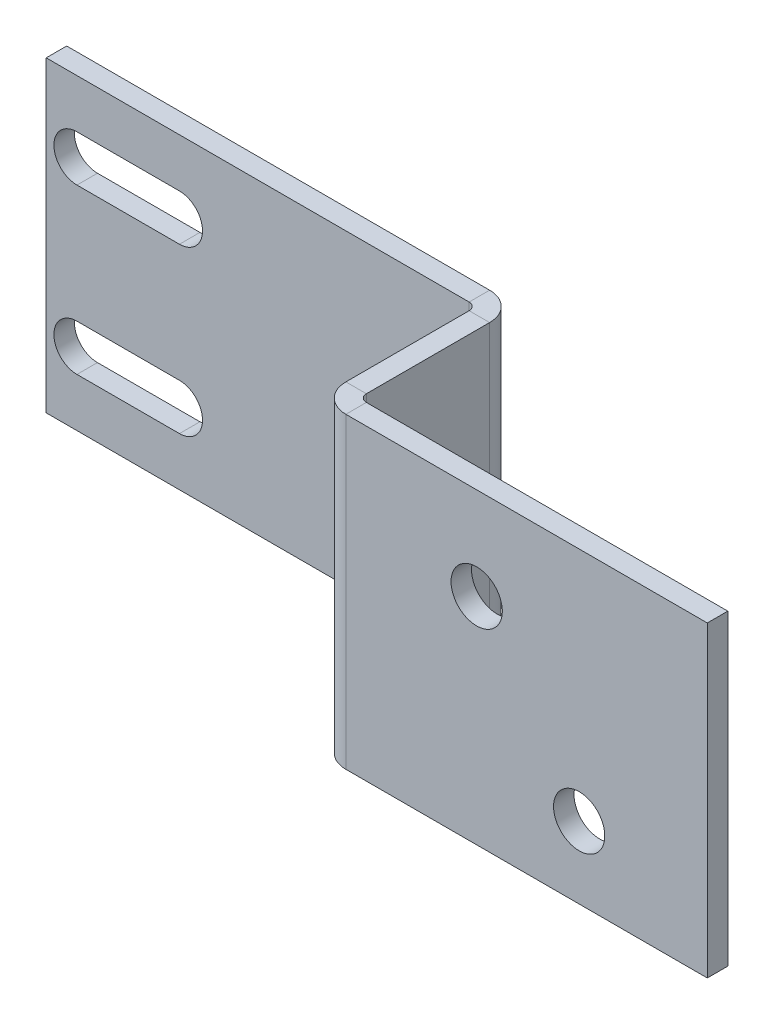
ISO-10303-21;
HEADER;
FILE_DESCRIPTION(('STEP AP214'),'2;1');
FILE_NAME('part.step','',(''),(''),'','','');
FILE_SCHEMA(('AUTOMOTIVE_DESIGN { 1 0 10303 214 1 1 1 1 }'));
ENDSEC;
DATA;
#1=APPLICATION_CONTEXT('core data for automotive mechanical design processes');
#2=APPLICATION_PROTOCOL_DEFINITION('international standard','automotive_design',2000,#1);
#3=PRODUCT_CONTEXT('',#1,'mechanical');
#4=PRODUCT('Part','Part','',(#3));
#5=PRODUCT_RELATED_PRODUCT_CATEGORY('part','',(#4));
#6=PRODUCT_DEFINITION_FORMATION('','',#4);
#7=PRODUCT_DEFINITION_CONTEXT('part definition',#1,'design');
#8=PRODUCT_DEFINITION('design','',#6,#7);
#9=PRODUCT_DEFINITION_SHAPE('','',#8);
#10=(LENGTH_UNIT() NAMED_UNIT(*) SI_UNIT(.MILLI.,.METRE.));
#11=(NAMED_UNIT(*) PLANE_ANGLE_UNIT() SI_UNIT($,.RADIAN.));
#12=(NAMED_UNIT(*) SI_UNIT($,.STERADIAN.) SOLID_ANGLE_UNIT());
#13=UNCERTAINTY_MEASURE_WITH_UNIT(LENGTH_MEASURE(1.E-05),#10,'distance_accuracy_value','');
#14=(GEOMETRIC_REPRESENTATION_CONTEXT(3) GLOBAL_UNCERTAINTY_ASSIGNED_CONTEXT((#13)) GLOBAL_UNIT_ASSIGNED_CONTEXT((#10,
#11,#12)) REPRESENTATION_CONTEXT('',''));
#15=CARTESIAN_POINT('',(0.,0.,0.));
#16=DIRECTION('',(0.,0.,1.));
#17=DIRECTION('',(1.,0.,0.));
#18=AXIS2_PLACEMENT_3D('',#15,#16,#17);
#19=CARTESIAN_POINT('',(32.,-51.5236276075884,0.));
#20=DIRECTION('',(0.,1.,0.));
#21=DIRECTION('',(-1.,0.,0.));
#22=AXIS2_PLACEMENT_3D('',#19,#20,#21);
#23=PLANE('',#22);
#24=DIRECTION('',(-1.,0.,0.));
#25=VECTOR('',#24,1.);
#26=CARTESIAN_POINT('',(32.,-51.5236276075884,12.7634));
#27=LINE('',#26,#25);
#28=CARTESIAN_POINT('',(32.,-51.5236276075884,12.7634));
#29=VERTEX_POINT('',#28);
#30=CARTESIAN_POINT('',(30.,-51.5236276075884,12.7634));
#31=VERTEX_POINT('',#30);
#32=EDGE_CURVE('E262',#29,#31,#27,.T.);
#33=ORIENTED_EDGE('',*,*,#32,.T.);
#34=DIRECTION('',(0.,0.,1.));
#35=VECTOR('',#34,1.);
#36=CARTESIAN_POINT('',(30.,-51.5236276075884,0.));
#37=LINE('',#36,#35);
#38=CARTESIAN_POINT('',(30.,-51.5236276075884,0.7366));
#39=VERTEX_POINT('',#38);
#40=EDGE_CURVE('E287',#31,#39,#37,.F.);
#41=ORIENTED_EDGE('',*,*,#40,.T.);
#42=DIRECTION('',(-1.,0.,0.));
#43=VECTOR('',#42,1.);
#44=CARTESIAN_POINT('',(32.,-51.5236276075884,0.73659999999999));
#45=LINE('',#44,#43);
#46=CARTESIAN_POINT('',(32.,-51.5236276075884,0.73659999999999));
#47=VERTEX_POINT('',#46);
#48=EDGE_CURVE('E275',#39,#47,#45,.F.);
#49=ORIENTED_EDGE('',*,*,#48,.T.);
#50=DIRECTION('',(0.,0.,-1.));
#51=VECTOR('',#50,1.);
#52=CARTESIAN_POINT('',(32.,-51.5236276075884,-1.21586629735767E-13));
#53=LINE('',#52,#51);
#54=EDGE_CURVE('E282',#29,#47,#53,.T.);
#55=ORIENTED_EDGE('',*,*,#54,.F.);
#56=EDGE_LOOP('',(#33,#41,#49,#55));
#57=FACE_BOUND('',#56,.T.);
#58=ADVANCED_FACE('F16',(#57),#23,.F.);
#59=CARTESIAN_POINT('',(32.,-21.5236276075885,15.5));
#60=DIRECTION('',(0.,-1.,0.));
#61=DIRECTION('',(0.,0.,-1.));
#62=AXIS2_PLACEMENT_3D('',#59,#60,#61);
#63=PLANE('',#62);
#64=DIRECTION('',(-1.,0.,0.));
#65=VECTOR('',#64,1.);
#66=CARTESIAN_POINT('',(32.,-21.5236276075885,12.7634));
#67=LINE('',#66,#65);
#68=CARTESIAN_POINT('',(32.,-21.5236276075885,12.7634));
#69=VERTEX_POINT('',#68);
#70=CARTESIAN_POINT('',(30.,-21.5236276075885,12.7634));
#71=VERTEX_POINT('',#70);
#72=EDGE_CURVE('E272',#69,#71,#67,.T.);
#73=ORIENTED_EDGE('',*,*,#72,.F.);
#74=DIRECTION('',(0.,0.,1.));
#75=VECTOR('',#74,1.);
#76=CARTESIAN_POINT('',(32.,-21.5236276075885,-1.45675366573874E-13));
#77=LINE('',#76,#75);
#78=CARTESIAN_POINT('',(32.,-21.5236276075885,0.736599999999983));
#79=VERTEX_POINT('',#78);
#80=EDGE_CURVE('E278',#79,#69,#77,.T.);
#81=ORIENTED_EDGE('',*,*,#80,.F.);
#82=DIRECTION('',(-1.,0.,0.));
#83=VECTOR('',#82,1.);
#84=CARTESIAN_POINT('',(30.,-21.5236276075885,0.73659999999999));
#85=LINE('',#84,#83);
#86=CARTESIAN_POINT('',(30.,-21.5236276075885,0.73659999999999));
#87=VERTEX_POINT('',#86);
#88=EDGE_CURVE('E292',#87,#79,#85,.F.);
#89=ORIENTED_EDGE('',*,*,#88,.F.);
#90=DIRECTION('',(0.,0.,-1.));
#91=VECTOR('',#90,1.);
#92=CARTESIAN_POINT('',(30.,-21.5236276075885,15.5));
#93=LINE('',#92,#91);
#94=EDGE_CURVE('E284',#87,#71,#93,.F.);
#95=ORIENTED_EDGE('',*,*,#94,.T.);
#96=EDGE_LOOP('',(#73,#81,#89,#95));
#97=FACE_BOUND('',#96,.T.);
#98=ADVANCED_FACE('F372',(#97),#63,.F.);
#99=CARTESIAN_POINT('',(32.,0.,-1.21586629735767E-13));
#100=DIRECTION('',(-1.,0.,0.));
#101=DIRECTION('',(0.,0.,1.));
#102=AXIS2_PLACEMENT_3D('',#99,#100,#101);
#103=PLANE('',#102);
#104=DIRECTION('',(0.,-1.,0.));
#105=VECTOR('',#104,1.);
#106=CARTESIAN_POINT('',(32.,-51.5236276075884,12.7634));
#107=LINE('',#106,#105);
#108=EDGE_CURVE('E268',#29,#69,#107,.F.);
#109=ORIENTED_EDGE('',*,*,#108,.F.);
#110=ORIENTED_EDGE('',*,*,#54,.T.);
#111=DIRECTION('',(0.,1.,0.));
#112=VECTOR('',#111,1.);
#113=CARTESIAN_POINT('',(32.,-51.5236276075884,0.73659999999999));
#114=LINE('',#113,#112);
#115=EDGE_CURVE('E289',#79,#47,#114,.F.);
#116=ORIENTED_EDGE('',*,*,#115,.F.);
#117=ORIENTED_EDGE('',*,*,#80,.T.);
#118=EDGE_LOOP('',(#109,#110,#116,#117));
#119=FACE_BOUND('',#118,.T.);
#120=ADVANCED_FACE('F375',(#119),#103,.F.);
#121=CARTESIAN_POINT('',(30.,0.,-1.1460366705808E-13));
#122=DIRECTION('',(-1.,0.,0.));
#123=DIRECTION('',(0.,0.,1.));
#124=AXIS2_PLACEMENT_3D('',#121,#122,#123);
#125=PLANE('',#124);
#126=ORIENTED_EDGE('',*,*,#40,.F.);
#127=DIRECTION('',(0.,-1.,0.));
#128=VECTOR('',#127,1.);
#129=CARTESIAN_POINT('',(30.,-51.5236276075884,12.7634));
#130=LINE('',#129,#128);
#131=EDGE_CURVE('E255',#31,#71,#130,.F.);
#132=ORIENTED_EDGE('',*,*,#131,.T.);
#133=ORIENTED_EDGE('',*,*,#94,.F.);
#134=DIRECTION('',(0.,1.,0.));
#135=VECTOR('',#134,1.);
#136=CARTESIAN_POINT('',(30.,-51.5236276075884,0.7366));
#137=LINE('',#136,#135);
#138=EDGE_CURVE('E295',#39,#87,#137,.T.);
#139=ORIENTED_EDGE('',*,*,#138,.F.);
#140=EDGE_LOOP('',(#126,#132,#133,#139));
#141=FACE_BOUND('',#140,.T.);
#142=ADVANCED_FACE('F363',(#141),#125,.T.);
#143=CARTESIAN_POINT('',(-12.,-21.5236276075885,-2.));
#144=DIRECTION('',(0.,1.,0.));
#145=DIRECTION('',(0.,0.,1.));
#146=AXIS2_PLACEMENT_3D('',#143,#144,#145);
#147=PLANE('',#146);
#148=DIRECTION('',(-1.,0.,0.));
#149=VECTOR('',#148,1.);
#150=CARTESIAN_POINT('',(-12.,-21.5236276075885,0.));
#151=LINE('',#150,#149);
#152=CARTESIAN_POINT('',(29.2634,-21.5236276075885,0.));
#153=VERTEX_POINT('',#152);
#154=CARTESIAN_POINT('',(-12.,-21.5236276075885,0.));
#155=VERTEX_POINT('',#154);
#156=EDGE_CURVE('E326',#153,#155,#151,.T.);
#157=ORIENTED_EDGE('',*,*,#156,.F.);
#158=DIRECTION('',(0.,0.,-1.));
#159=VECTOR('',#158,1.);
#160=CARTESIAN_POINT('',(29.2634,-21.5236276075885,0.));
#161=LINE('',#160,#159);
#162=CARTESIAN_POINT('',(29.2634,-21.5236276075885,-2.));
#163=VERTEX_POINT('',#162);
#164=EDGE_CURVE('E305',#153,#163,#161,.T.);
#165=ORIENTED_EDGE('',*,*,#164,.T.);
#166=DIRECTION('',(-1.,0.,0.));
#167=VECTOR('',#166,1.);
#168=CARTESIAN_POINT('',(-12.,-21.5236276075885,-2.));
#169=LINE('',#168,#167);
#170=CARTESIAN_POINT('',(-12.,-21.5236276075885,-2.));
#171=VERTEX_POINT('',#170);
#172=EDGE_CURVE('E329',#163,#171,#169,.T.);
#173=ORIENTED_EDGE('',*,*,#172,.T.);
#174=DIRECTION('',(0.,0.,1.));
#175=VECTOR('',#174,1.);
#176=CARTESIAN_POINT('',(-12.,-21.5236276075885,-2.));
#177=LINE('',#176,#175);
#178=EDGE_CURVE('E11',#171,#155,#177,.T.);
#179=ORIENTED_EDGE('',*,*,#178,.T.);
#180=EDGE_LOOP('',(#157,#165,#173,#179));
#181=FACE_BOUND('',#180,.T.);
#182=ADVANCED_FACE('F343',(#181),#147,.T.);
#183=CARTESIAN_POINT('',(0.,0.,-2.));
#184=DIRECTION('',(0.,0.,1.));
#185=DIRECTION('',(1.,0.,0.));
#186=AXIS2_PLACEMENT_3D('',#183,#184,#185);
#187=PLANE('',#186);
#188=DIRECTION('',(-1.,0.,0.));
#189=VECTOR('',#188,1.);
#190=CARTESIAN_POINT('',(-9.,-42.2736276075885,-2.));
#191=LINE('',#190,#189);
#192=CARTESIAN_POINT('',(0.99999999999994,-42.2736276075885,-2.));
#193=VERTEX_POINT('',#192);
#194=CARTESIAN_POINT('',(-9.,-42.2736276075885,-2.));
#195=VERTEX_POINT('',#194);
#196=EDGE_CURVE('E161',#193,#195,#191,.T.);
#197=ORIENTED_EDGE('',*,*,#196,.T.);
#198=CARTESIAN_POINT('',(-9.,-44.5236276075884,-2.));
#199=DIRECTION('',(0.,0.,1.));
#200=DIRECTION('',(-1.,0.,0.));
#201=AXIS2_PLACEMENT_3D('',#198,#199,#200);
#202=CIRCLE('',#201,2.25);
#203=CARTESIAN_POINT('',(-9.,-46.7736276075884,-2.));
#204=VERTEX_POINT('',#203);
#205=EDGE_CURVE('E155',#195,#204,#202,.T.);
#206=ORIENTED_EDGE('',*,*,#205,.T.);
#207=DIRECTION('',(1.,0.,0.));
#208=VECTOR('',#207,1.);
#209=CARTESIAN_POINT('',(-9.,-46.7736276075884,-2.));
#210=LINE('',#209,#208);
#211=CARTESIAN_POINT('',(0.999999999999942,-46.7736276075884,-2.));
#212=VERTEX_POINT('',#211);
#213=EDGE_CURVE('E164',#204,#212,#210,.T.);
#214=ORIENTED_EDGE('',*,*,#213,.T.);
#215=CARTESIAN_POINT('',(0.999999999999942,-44.5236276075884,-2.));
#216=DIRECTION('',(0.,0.,1.));
#217=DIRECTION('',(-1.,0.,0.));
#218=AXIS2_PLACEMENT_3D('',#215,#216,#217);
#219=CIRCLE('',#218,2.25);
#220=EDGE_CURVE('E31',#212,#193,#219,.T.);
#221=ORIENTED_EDGE('',*,*,#220,.T.);
#222=EDGE_LOOP('',(#197,#206,#214,#221));
#223=FACE_BOUND('',#222,.T.);
#224=DIRECTION('',(-1.,0.,0.));
#225=VECTOR('',#224,1.);
#226=CARTESIAN_POINT('',(-9.,-26.2736276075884,-2.));
#227=LINE('',#226,#225);
#228=CARTESIAN_POINT('',(0.999999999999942,-26.2736276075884,-2.));
#229=VERTEX_POINT('',#228);
#230=CARTESIAN_POINT('',(-9.,-26.2736276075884,-2.));
#231=VERTEX_POINT('',#230);
#232=EDGE_CURVE('E203',#229,#231,#227,.T.);
#233=ORIENTED_EDGE('',*,*,#232,.T.);
#234=CARTESIAN_POINT('',(-9.,-28.5236276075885,-2.));
#235=DIRECTION('',(0.,0.,1.));
#236=DIRECTION('',(1.,0.,0.));
#237=AXIS2_PLACEMENT_3D('',#234,#235,#236);
#238=CIRCLE('',#237,2.25);
#239=CARTESIAN_POINT('',(-9.,-30.7736276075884,-2.));
#240=VERTEX_POINT('',#239);
#241=EDGE_CURVE('E193',#231,#240,#238,.T.);
#242=ORIENTED_EDGE('',*,*,#241,.T.);
#243=DIRECTION('',(1.,0.,0.));
#244=VECTOR('',#243,1.);
#245=CARTESIAN_POINT('',(-9.,-30.7736276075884,-2.));
#246=LINE('',#245,#244);
#247=CARTESIAN_POINT('',(0.999999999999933,-30.7736276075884,-2.));
#248=VERTEX_POINT('',#247);
#249=EDGE_CURVE('E196',#240,#248,#246,.T.);
#250=ORIENTED_EDGE('',*,*,#249,.T.);
#251=CARTESIAN_POINT('',(0.999999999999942,-28.5236276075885,-2.));
#252=DIRECTION('',(0.,0.,1.));
#253=DIRECTION('',(1.,0.,0.));
#254=AXIS2_PLACEMENT_3D('',#251,#252,#253);
#255=CIRCLE('',#254,2.25);
#256=EDGE_CURVE('E200',#248,#229,#255,.T.);
#257=ORIENTED_EDGE('',*,*,#256,.T.);
#258=EDGE_LOOP('',(#233,#242,#250,#257));
#259=FACE_BOUND('',#258,.T.);
#260=DIRECTION('',(0.,1.,0.));
#261=VECTOR('',#260,1.);
#262=CARTESIAN_POINT('',(29.2634,-21.5236276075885,-2.));
#263=LINE('',#262,#261);
#264=CARTESIAN_POINT('',(29.2634,-51.5236276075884,-2.));
#265=VERTEX_POINT('',#264);
#266=EDGE_CURVE('E299',#163,#265,#263,.F.);
#267=ORIENTED_EDGE('',*,*,#266,.T.);
#268=DIRECTION('',(1.,0.,0.));
#269=VECTOR('',#268,1.);
#270=CARTESIAN_POINT('',(-12.,-51.5236276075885,-2.));
#271=LINE('',#270,#269);
#272=CARTESIAN_POINT('',(-12.,-51.5236276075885,-2.));
#273=VERTEX_POINT('',#272);
#274=EDGE_CURVE('E325',#273,#265,#271,.T.);
#275=ORIENTED_EDGE('',*,*,#274,.F.);
#276=DIRECTION('',(0.,-1.,0.));
#277=VECTOR('',#276,1.);
#278=CARTESIAN_POINT('',(-12.,-21.5236276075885,-2.));
#279=LINE('',#278,#277);
#280=EDGE_CURVE('E322',#171,#273,#279,.T.);
#281=ORIENTED_EDGE('',*,*,#280,.F.);
#282=ORIENTED_EDGE('',*,*,#172,.F.);
#283=EDGE_LOOP('',(#267,#275,#281,#282));
#284=FACE_BOUND('',#283,.T.);
#285=ADVANCED_FACE('F168',(#223,#259,#284),#187,.F.);
#286=CARTESIAN_POINT('',(0.,0.,0.));
#287=DIRECTION('',(0.,0.,1.));
#288=DIRECTION('',(1.,0.,0.));
#289=AXIS2_PLACEMENT_3D('',#286,#287,#288);
#290=PLANE('',#289);
#291=CARTESIAN_POINT('',(-9.,-44.5236276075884,0.));
#292=DIRECTION('',(0.,0.,1.));
#293=DIRECTION('',(-1.,0.,0.));
#294=AXIS2_PLACEMENT_3D('',#291,#292,#293);
#295=CIRCLE('',#294,2.25);
#296=CARTESIAN_POINT('',(-9.,-42.2736276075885,0.));
#297=VERTEX_POINT('',#296);
#298=CARTESIAN_POINT('',(-9.,-46.7736276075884,0.));
#299=VERTEX_POINT('',#298);
#300=EDGE_CURVE('E39',#297,#299,#295,.T.);
#301=ORIENTED_EDGE('',*,*,#300,.F.);
#302=DIRECTION('',(-1.,0.,0.));
#303=VECTOR('',#302,1.);
#304=CARTESIAN_POINT('',(-9.,-42.2736276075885,0.));
#305=LINE('',#304,#303);
#306=CARTESIAN_POINT('',(0.99999999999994,-42.2736276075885,0.));
#307=VERTEX_POINT('',#306);
#308=EDGE_CURVE('E171',#307,#297,#305,.T.);
#309=ORIENTED_EDGE('',*,*,#308,.F.);
#310=CARTESIAN_POINT('',(0.999999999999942,-44.5236276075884,0.));
#311=DIRECTION('',(0.,0.,1.));
#312=DIRECTION('',(-1.,0.,0.));
#313=AXIS2_PLACEMENT_3D('',#310,#311,#312);
#314=CIRCLE('',#313,2.25);
#315=CARTESIAN_POINT('',(0.999999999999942,-46.7736276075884,0.));
#316=VERTEX_POINT('',#315);
#317=EDGE_CURVE('E174',#316,#307,#314,.T.);
#318=ORIENTED_EDGE('',*,*,#317,.F.);
#319=DIRECTION('',(1.,0.,0.));
#320=VECTOR('',#319,1.);
#321=CARTESIAN_POINT('',(-9.,-46.7736276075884,0.));
#322=LINE('',#321,#320);
#323=EDGE_CURVE('E183',#299,#316,#322,.T.);
#324=ORIENTED_EDGE('',*,*,#323,.F.);
#325=EDGE_LOOP('',(#301,#309,#318,#324));
#326=FACE_BOUND('',#325,.T.);
#327=CARTESIAN_POINT('',(-9.,-28.5236276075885,0.));
#328=DIRECTION('',(0.,0.,1.));
#329=DIRECTION('',(1.,0.,0.));
#330=AXIS2_PLACEMENT_3D('',#327,#328,#329);
#331=CIRCLE('',#330,2.25);
#332=CARTESIAN_POINT('',(-9.,-26.2736276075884,0.));
#333=VERTEX_POINT('',#332);
#334=CARTESIAN_POINT('',(-9.,-30.7736276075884,0.));
#335=VERTEX_POINT('',#334);
#336=EDGE_CURVE('E189',#333,#335,#331,.T.);
#337=ORIENTED_EDGE('',*,*,#336,.F.);
#338=DIRECTION('',(-1.,0.,0.));
#339=VECTOR('',#338,1.);
#340=CARTESIAN_POINT('',(-9.,-26.2736276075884,0.));
#341=LINE('',#340,#339);
#342=CARTESIAN_POINT('',(0.999999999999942,-26.2736276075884,0.));
#343=VERTEX_POINT('',#342);
#344=EDGE_CURVE('E197',#343,#333,#341,.T.);
#345=ORIENTED_EDGE('',*,*,#344,.F.);
#346=CARTESIAN_POINT('',(0.999999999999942,-28.5236276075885,0.));
#347=DIRECTION('',(0.,0.,1.));
#348=DIRECTION('',(1.,0.,0.));
#349=AXIS2_PLACEMENT_3D('',#346,#347,#348);
#350=CIRCLE('',#349,2.25);
#351=CARTESIAN_POINT('',(0.999999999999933,-30.7736276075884,0.));
#352=VERTEX_POINT('',#351);
#353=EDGE_CURVE('E211',#352,#343,#350,.T.);
#354=ORIENTED_EDGE('',*,*,#353,.F.);
#355=DIRECTION('',(1.,0.,0.));
#356=VECTOR('',#355,1.);
#357=CARTESIAN_POINT('',(-9.,-30.7736276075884,0.));
#358=LINE('',#357,#356);
#359=EDGE_CURVE('E208',#335,#352,#358,.T.);
#360=ORIENTED_EDGE('',*,*,#359,.F.);
#361=EDGE_LOOP('',(#337,#345,#354,#360));
#362=FACE_BOUND('',#361,.T.);
#363=DIRECTION('',(1.,0.,0.));
#364=VECTOR('',#363,1.);
#365=CARTESIAN_POINT('',(-12.,-51.5236276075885,0.));
#366=LINE('',#365,#364);
#367=CARTESIAN_POINT('',(-12.,-51.5236276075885,0.));
#368=VERTEX_POINT('',#367);
#369=CARTESIAN_POINT('',(29.2634,-51.5236276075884,0.));
#370=VERTEX_POINT('',#369);
#371=EDGE_CURVE('E333',#368,#370,#366,.T.);
#372=ORIENTED_EDGE('',*,*,#371,.T.);
#373=DIRECTION('',(0.,1.,0.));
#374=VECTOR('',#373,1.);
#375=CARTESIAN_POINT('',(29.2634,-21.5236276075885,0.));
#376=LINE('',#375,#374);
#377=EDGE_CURVE('E311',#153,#370,#376,.F.);
#378=ORIENTED_EDGE('',*,*,#377,.F.);
#379=ORIENTED_EDGE('',*,*,#156,.T.);
#380=DIRECTION('',(0.,-1.,0.));
#381=VECTOR('',#380,1.);
#382=CARTESIAN_POINT('',(-12.,-21.5236276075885,0.));
#383=LINE('',#382,#381);
#384=EDGE_CURVE('E319',#155,#368,#383,.T.);
#385=ORIENTED_EDGE('',*,*,#384,.T.);
#386=EDGE_LOOP('',(#372,#378,#379,#385));
#387=FACE_BOUND('',#386,.T.);
#388=ADVANCED_FACE('F338',(#326,#362,#387),#290,.T.);
#389=CARTESIAN_POINT('',(-12.,-21.5236276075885,-2.));
#390=DIRECTION('',(-1.,0.,0.));
#391=DIRECTION('',(0.,-1.,0.));
#392=AXIS2_PLACEMENT_3D('',#389,#390,#391);
#393=PLANE('',#392);
#394=ORIENTED_EDGE('',*,*,#384,.F.);
#395=ORIENTED_EDGE('',*,*,#178,.F.);
#396=ORIENTED_EDGE('',*,*,#280,.T.);
#397=DIRECTION('',(0.,0.,1.));
#398=VECTOR('',#397,1.);
#399=CARTESIAN_POINT('',(-12.,-51.5236276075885,-2.));
#400=LINE('',#399,#398);
#401=EDGE_CURVE('E20',#273,#368,#400,.T.);
#402=ORIENTED_EDGE('',*,*,#401,.T.);
#403=EDGE_LOOP('',(#394,#395,#396,#402));
#404=FACE_BOUND('',#403,.T.);
#405=ADVANCED_FACE('F18',(#404),#393,.T.);
#406=CARTESIAN_POINT('',(-12.,-51.5236276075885,-2.));
#407=DIRECTION('',(0.,-1.,0.));
#408=DIRECTION('',(0.,0.,-1.));
#409=AXIS2_PLACEMENT_3D('',#406,#407,#408);
#410=PLANE('',#409);
#411=DIRECTION('',(0.,0.,-1.));
#412=VECTOR('',#411,1.);
#413=CARTESIAN_POINT('',(29.2634,-51.5236276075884,0.));
#414=LINE('',#413,#412);
#415=EDGE_CURVE('E316',#370,#265,#414,.T.);
#416=ORIENTED_EDGE('',*,*,#415,.F.);
#417=ORIENTED_EDGE('',*,*,#371,.F.);
#418=ORIENTED_EDGE('',*,*,#401,.F.);
#419=ORIENTED_EDGE('',*,*,#274,.T.);
#420=EDGE_LOOP('',(#416,#417,#418,#419));
#421=FACE_BOUND('',#420,.T.);
#422=ADVANCED_FACE('F349',(#421),#410,.T.);
#423=CARTESIAN_POINT('',(29.2634,-51.5236276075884,0.7366));
#424=DIRECTION('',(0.,-1.,0.));
#425=DIRECTION('',(0.,0.,-1.));
#426=AXIS2_PLACEMENT_3D('',#423,#424,#425);
#427=PLANE('',#426);
#428=ORIENTED_EDGE('',*,*,#48,.F.);
#429=CARTESIAN_POINT('',(29.2634,-51.5236276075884,0.7366));
#430=DIRECTION('',(0.,1.,0.));
#431=DIRECTION('',(0.,0.,1.));
#432=AXIS2_PLACEMENT_3D('',#429,#430,#431);
#433=CIRCLE('',#432,0.7366);
#434=EDGE_CURVE('E308',#370,#39,#433,.F.);
#435=ORIENTED_EDGE('',*,*,#434,.F.);
#436=ORIENTED_EDGE('',*,*,#415,.T.);
#437=CARTESIAN_POINT('',(29.2634,-51.5236276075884,0.7366));
#438=DIRECTION('',(0.,1.,0.));
#439=DIRECTION('',(0.,0.,1.));
#440=AXIS2_PLACEMENT_3D('',#437,#438,#439);
#441=CIRCLE('',#440,2.7366);
#442=EDGE_CURVE('E301',#265,#47,#441,.F.);
#443=ORIENTED_EDGE('',*,*,#442,.T.);
#444=EDGE_LOOP('',(#428,#435,#436,#443));
#445=FACE_BOUND('',#444,.T.);
#446=ADVANCED_FACE('F357',(#445),#427,.T.);
#447=CARTESIAN_POINT('',(29.2634,-21.5236276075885,0.7366));
#448=DIRECTION('',(0.,-1.,0.));
#449=DIRECTION('',(0.,0.,-1.));
#450=AXIS2_PLACEMENT_3D('',#447,#448,#449);
#451=PLANE('',#450);
#452=CARTESIAN_POINT('',(29.2634,-21.5236276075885,0.7366));
#453=DIRECTION('',(0.,1.,0.));
#454=DIRECTION('',(0.,0.,1.));
#455=AXIS2_PLACEMENT_3D('',#452,#453,#454);
#456=CIRCLE('',#455,0.7366);
#457=EDGE_CURVE('E281',#87,#153,#456,.T.);
#458=ORIENTED_EDGE('',*,*,#457,.F.);
#459=ORIENTED_EDGE('',*,*,#88,.T.);
#460=CARTESIAN_POINT('',(29.2634,-21.5236276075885,0.7366));
#461=DIRECTION('',(0.,1.,0.));
#462=DIRECTION('',(0.,0.,1.));
#463=AXIS2_PLACEMENT_3D('',#460,#461,#462);
#464=CIRCLE('',#463,2.7366);
#465=EDGE_CURVE('E302',#79,#163,#464,.T.);
#466=ORIENTED_EDGE('',*,*,#465,.T.);
#467=ORIENTED_EDGE('',*,*,#164,.F.);
#468=EDGE_LOOP('',(#458,#459,#466,#467));
#469=FACE_BOUND('',#468,.T.);
#470=ADVANCED_FACE('F367',(#469),#451,.F.);
#471=CARTESIAN_POINT('',(29.2634,-21.5236276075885,0.7366));
#472=DIRECTION('',(0.,1.,0.));
#473=DIRECTION('',(1.,0.,0.));
#474=AXIS2_PLACEMENT_3D('',#471,#472,#473);
#475=CYLINDRICAL_SURFACE('',#474,2.7366);
#476=ORIENTED_EDGE('',*,*,#266,.F.);
#477=ORIENTED_EDGE('',*,*,#465,.F.);
#478=ORIENTED_EDGE('',*,*,#115,.T.);
#479=ORIENTED_EDGE('',*,*,#442,.F.);
#480=EDGE_LOOP('',(#476,#477,#478,#479));
#481=FACE_BOUND('',#480,.T.);
#482=ADVANCED_FACE('F378',(#481),#475,.T.);
#483=CARTESIAN_POINT('',(29.2634,-21.5236276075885,0.7366));
#484=DIRECTION('',(0.,1.,0.));
#485=DIRECTION('',(1.,0.,0.));
#486=AXIS2_PLACEMENT_3D('',#483,#484,#485);
#487=CYLINDRICAL_SURFACE('',#486,0.7366);
#488=ORIENTED_EDGE('',*,*,#377,.T.);
#489=ORIENTED_EDGE('',*,*,#434,.T.);
#490=ORIENTED_EDGE('',*,*,#138,.T.);
#491=ORIENTED_EDGE('',*,*,#457,.T.);
#492=EDGE_LOOP('',(#488,#489,#490,#491));
#493=FACE_BOUND('',#492,.T.);
#494=ADVANCED_FACE('F352',(#493),#487,.F.);
#495=CARTESIAN_POINT('',(32.7366,-21.5236276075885,12.7634));
#496=DIRECTION('',(0.,1.,0.));
#497=DIRECTION('',(0.,0.,1.));
#498=AXIS2_PLACEMENT_3D('',#495,#496,#497);
#499=PLANE('',#498);
#500=DIRECTION('',(0.,0.,-1.));
#501=VECTOR('',#500,1.);
#502=CARTESIAN_POINT('',(32.7366,-21.5236276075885,15.5));
#503=LINE('',#502,#501);
#504=CARTESIAN_POINT('',(32.7366,-21.5236276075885,13.5));
#505=VERTEX_POINT('',#504);
#506=CARTESIAN_POINT('',(32.7366,-21.5236276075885,15.5));
#507=VERTEX_POINT('',#506);
#508=EDGE_CURVE('E218',#505,#507,#503,.F.);
#509=ORIENTED_EDGE('',*,*,#508,.F.);
#510=CARTESIAN_POINT('',(32.7366,-21.5236276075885,12.7634));
#511=DIRECTION('',(0.,-1.,0.));
#512=DIRECTION('',(0.,0.,-1.));
#513=AXIS2_PLACEMENT_3D('',#510,#511,#512);
#514=CIRCLE('',#513,0.736600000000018);
#515=EDGE_CURVE('E265',#69,#505,#514,.F.);
#516=ORIENTED_EDGE('',*,*,#515,.F.);
#517=ORIENTED_EDGE('',*,*,#72,.T.);
#518=CARTESIAN_POINT('',(32.7366,-21.5236276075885,12.7634));
#519=DIRECTION('',(0.,-1.,0.));
#520=DIRECTION('',(0.,0.,-1.));
#521=AXIS2_PLACEMENT_3D('',#518,#519,#520);
#522=CIRCLE('',#521,2.7366);
#523=EDGE_CURVE('E258',#71,#507,#522,.F.);
#524=ORIENTED_EDGE('',*,*,#523,.T.);
#525=EDGE_LOOP('',(#509,#516,#517,#524));
#526=FACE_BOUND('',#525,.T.);
#527=ADVANCED_FACE('F405',(#526),#499,.T.);
#528=CARTESIAN_POINT('',(32.7366,-51.5236276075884,12.7634));
#529=DIRECTION('',(0.,1.,0.));
#530=DIRECTION('',(0.,0.,1.));
#531=AXIS2_PLACEMENT_3D('',#528,#529,#530);
#532=PLANE('',#531);
#533=CARTESIAN_POINT('',(32.7366,-51.5236276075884,12.7634));
#534=DIRECTION('',(0.,-1.,0.));
#535=DIRECTION('',(0.,0.,-1.));
#536=AXIS2_PLACEMENT_3D('',#533,#534,#535);
#537=CIRCLE('',#536,0.736600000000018);
#538=CARTESIAN_POINT('',(32.7366,-51.5236276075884,13.5));
#539=VERTEX_POINT('',#538);
#540=EDGE_CURVE('E228',#539,#29,#537,.T.);
#541=ORIENTED_EDGE('',*,*,#540,.F.);
#542=DIRECTION('',(0.,0.,-1.));
#543=VECTOR('',#542,1.);
#544=CARTESIAN_POINT('',(32.7366,-51.5236276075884,13.5));
#545=LINE('',#544,#543);
#546=CARTESIAN_POINT('',(32.7366,-51.5236276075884,15.5));
#547=VERTEX_POINT('',#546);
#548=EDGE_CURVE('E248',#539,#547,#545,.F.);
#549=ORIENTED_EDGE('',*,*,#548,.T.);
#550=CARTESIAN_POINT('',(32.7366,-51.5236276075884,12.7634));
#551=DIRECTION('',(0.,-1.,0.));
#552=DIRECTION('',(0.,0.,-1.));
#553=AXIS2_PLACEMENT_3D('',#550,#551,#552);
#554=CIRCLE('',#553,2.7366);
#555=EDGE_CURVE('E259',#547,#31,#554,.T.);
#556=ORIENTED_EDGE('',*,*,#555,.T.);
#557=ORIENTED_EDGE('',*,*,#32,.F.);
#558=EDGE_LOOP('',(#541,#549,#556,#557));
#559=FACE_BOUND('',#558,.T.);
#560=ADVANCED_FACE('F433',(#559),#532,.F.);
#561=CARTESIAN_POINT('',(32.7366,-51.5236276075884,12.7634));
#562=DIRECTION('',(0.,-1.,0.));
#563=DIRECTION('',(0.,0.,1.));
#564=AXIS2_PLACEMENT_3D('',#561,#562,#563);
#565=CYLINDRICAL_SURFACE('',#564,2.7366);
#566=ORIENTED_EDGE('',*,*,#131,.F.);
#567=ORIENTED_EDGE('',*,*,#555,.F.);
#568=DIRECTION('',(0.,-1.,0.));
#569=VECTOR('',#568,1.);
#570=CARTESIAN_POINT('',(32.7366,-21.5236276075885,15.5));
#571=LINE('',#570,#569);
#572=EDGE_CURVE('E246',#547,#507,#571,.F.);
#573=ORIENTED_EDGE('',*,*,#572,.T.);
#574=ORIENTED_EDGE('',*,*,#523,.F.);
#575=EDGE_LOOP('',(#566,#567,#573,#574));
#576=FACE_BOUND('',#575,.T.);
#577=ADVANCED_FACE('F442',(#576),#565,.T.);
#578=CARTESIAN_POINT('',(32.7366,-51.5236276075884,12.7634));
#579=DIRECTION('',(0.,-1.,0.));
#580=DIRECTION('',(0.,0.,1.));
#581=AXIS2_PLACEMENT_3D('',#578,#579,#580);
#582=CYLINDRICAL_SURFACE('',#581,0.736600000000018);
#583=ORIENTED_EDGE('',*,*,#108,.T.);
#584=ORIENTED_EDGE('',*,*,#515,.T.);
#585=DIRECTION('',(0.,-1.,0.));
#586=VECTOR('',#585,1.);
#587=CARTESIAN_POINT('',(32.7366,-21.5236276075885,13.5));
#588=LINE('',#587,#586);
#589=EDGE_CURVE('E251',#505,#539,#588,.T.);
#590=ORIENTED_EDGE('',*,*,#589,.T.);
#591=ORIENTED_EDGE('',*,*,#540,.T.);
#592=EDGE_LOOP('',(#583,#584,#590,#591));
#593=FACE_BOUND('',#592,.T.);
#594=ADVANCED_FACE('F451',(#593),#582,.F.);
#595=CARTESIAN_POINT('',(32.,-21.5236276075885,15.5));
#596=DIRECTION('',(0.,-1.,0.));
#597=DIRECTION('',(1.,0.,0.));
#598=AXIS2_PLACEMENT_3D('',#595,#596,#597);
#599=PLANE('',#598);
#600=ORIENTED_EDGE('',*,*,#508,.T.);
#601=DIRECTION('',(-1.,0.,0.));
#602=VECTOR('',#601,1.);
#603=CARTESIAN_POINT('',(0.,-21.5236276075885,15.5));
#604=LINE('',#603,#602);
#605=CARTESIAN_POINT('',(68.,-21.5236276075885,15.5));
#606=VERTEX_POINT('',#605);
#607=EDGE_CURVE('E236',#606,#507,#604,.T.);
#608=ORIENTED_EDGE('',*,*,#607,.F.);
#609=DIRECTION('',(0.,0.,-1.));
#610=VECTOR('',#609,1.);
#611=CARTESIAN_POINT('',(68.,-21.5236276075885,15.5));
#612=LINE('',#611,#610);
#613=CARTESIAN_POINT('',(68.,-21.5236276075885,13.5));
#614=VERTEX_POINT('',#613);
#615=EDGE_CURVE('E229',#606,#614,#612,.T.);
#616=ORIENTED_EDGE('',*,*,#615,.T.);
#617=DIRECTION('',(1.,0.,0.));
#618=VECTOR('',#617,1.);
#619=CARTESIAN_POINT('',(32.,-21.5236276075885,13.5));
#620=LINE('',#619,#618);
#621=EDGE_CURVE('E243',#614,#505,#620,.F.);
#622=ORIENTED_EDGE('',*,*,#621,.T.);
#623=EDGE_LOOP('',(#600,#608,#616,#622));
#624=FACE_BOUND('',#623,.T.);
#625=ADVANCED_FACE('F459',(#624),#599,.F.);
#626=CARTESIAN_POINT('',(68.,-51.5236276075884,15.5));
#627=DIRECTION('',(0.,1.,0.));
#628=DIRECTION('',(-1.,0.,0.));
#629=AXIS2_PLACEMENT_3D('',#626,#627,#628);
#630=PLANE('',#629);
#631=ORIENTED_EDGE('',*,*,#548,.F.);
#632=DIRECTION('',(-1.,0.,0.));
#633=VECTOR('',#632,1.);
#634=CARTESIAN_POINT('',(68.,-51.5236276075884,13.5));
#635=LINE('',#634,#633);
#636=CARTESIAN_POINT('',(68.,-51.5236276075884,13.5));
#637=VERTEX_POINT('',#636);
#638=EDGE_CURVE('E241',#539,#637,#635,.F.);
#639=ORIENTED_EDGE('',*,*,#638,.T.);
#640=DIRECTION('',(0.,0.,-1.));
#641=VECTOR('',#640,1.);
#642=CARTESIAN_POINT('',(68.,-51.5236276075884,15.5));
#643=LINE('',#642,#641);
#644=CARTESIAN_POINT('',(68.,-51.5236276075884,15.5));
#645=VERTEX_POINT('',#644);
#646=EDGE_CURVE('E225',#645,#637,#643,.T.);
#647=ORIENTED_EDGE('',*,*,#646,.F.);
#648=DIRECTION('',(1.,0.,0.));
#649=VECTOR('',#648,1.);
#650=CARTESIAN_POINT('',(0.,-51.5236276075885,15.5));
#651=LINE('',#650,#649);
#652=EDGE_CURVE('E234',#547,#645,#651,.T.);
#653=ORIENTED_EDGE('',*,*,#652,.F.);
#654=EDGE_LOOP('',(#631,#639,#647,#653));
#655=FACE_BOUND('',#654,.T.);
#656=ADVANCED_FACE('F475',(#655),#630,.F.);
#657=CARTESIAN_POINT('',(0.,0.,15.5));
#658=DIRECTION('',(0.,0.,-1.));
#659=DIRECTION('',(-1.,0.,0.));
#660=AXIS2_PLACEMENT_3D('',#657,#658,#659);
#661=PLANE('',#660);
#662=CARTESIAN_POINT('',(45.5000000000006,-30.5271841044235,15.5));
#663=DIRECTION('',(0.,0.,-1.));
#664=DIRECTION('',(-1.,0.,0.));
#665=AXIS2_PLACEMENT_3D('',#662,#663,#664);
#666=CIRCLE('',#665,2.5);
#667=CARTESIAN_POINT('',(43.0000000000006,-30.5271841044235,15.5));
#668=VERTEX_POINT('',#667);
#669=EDGE_CURVE('E699',#668,#668,#666,.T.);
#670=ORIENTED_EDGE('',*,*,#669,.T.);
#671=EDGE_LOOP('',(#670));
#672=FACE_BOUND('',#671,.T.);
#673=CARTESIAN_POINT('',(55.5000000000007,-44.5271841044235,15.5));
#674=DIRECTION('',(0.,0.,-1.));
#675=DIRECTION('',(-1.,0.,0.));
#676=AXIS2_PLACEMENT_3D('',#673,#674,#675);
#677=CIRCLE('',#676,2.5);
#678=CARTESIAN_POINT('',(53.0000000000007,-44.5271841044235,15.5));
#679=VERTEX_POINT('',#678);
#680=EDGE_CURVE('E177',#679,#679,#677,.T.);
#681=ORIENTED_EDGE('',*,*,#680,.T.);
#682=EDGE_LOOP('',(#681));
#683=FACE_BOUND('',#682,.T.);
#684=ORIENTED_EDGE('',*,*,#572,.F.);
#685=ORIENTED_EDGE('',*,*,#652,.T.);
#686=DIRECTION('',(0.,1.,0.));
#687=VECTOR('',#686,1.);
#688=CARTESIAN_POINT('',(68.,0.,15.5));
#689=LINE('',#688,#687);
#690=EDGE_CURVE('E232',#645,#606,#689,.T.);
#691=ORIENTED_EDGE('',*,*,#690,.T.);
#692=ORIENTED_EDGE('',*,*,#607,.T.);
#693=EDGE_LOOP('',(#684,#685,#691,#692));
#694=FACE_BOUND('',#693,.T.);
#695=ADVANCED_FACE('F484',(#672,#683,#694),#661,.F.);
#696=CARTESIAN_POINT('',(0.,0.,13.5));
#697=DIRECTION('',(0.,0.,-1.));
#698=DIRECTION('',(-1.,0.,0.));
#699=AXIS2_PLACEMENT_3D('',#696,#697,#698);
#700=PLANE('',#699);
#701=CARTESIAN_POINT('',(45.5000000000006,-30.5271841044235,13.5));
#702=DIRECTION('',(0.,0.,-1.));
#703=DIRECTION('',(-1.,0.,0.));
#704=AXIS2_PLACEMENT_3D('',#701,#702,#703);
#705=CIRCLE('',#704,2.5);
#706=CARTESIAN_POINT('',(43.0000000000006,-30.5271841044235,13.5));
#707=VERTEX_POINT('',#706);
#708=EDGE_CURVE('E702',#707,#707,#705,.T.);
#709=ORIENTED_EDGE('',*,*,#708,.F.);
#710=EDGE_LOOP('',(#709));
#711=FACE_BOUND('',#710,.T.);
#712=CARTESIAN_POINT('',(55.5000000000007,-44.5271841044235,13.5));
#713=DIRECTION('',(0.,0.,-1.));
#714=DIRECTION('',(-1.,0.,0.));
#715=AXIS2_PLACEMENT_3D('',#712,#713,#714);
#716=CIRCLE('',#715,2.5);
#717=CARTESIAN_POINT('',(53.0000000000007,-44.5271841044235,13.5));
#718=VERTEX_POINT('',#717);
#719=EDGE_CURVE('E704',#718,#718,#716,.T.);
#720=ORIENTED_EDGE('',*,*,#719,.F.);
#721=EDGE_LOOP('',(#720));
#722=FACE_BOUND('',#721,.T.);
#723=ORIENTED_EDGE('',*,*,#638,.F.);
#724=ORIENTED_EDGE('',*,*,#589,.F.);
#725=ORIENTED_EDGE('',*,*,#621,.F.);
#726=DIRECTION('',(0.,-1.,0.));
#727=VECTOR('',#726,1.);
#728=CARTESIAN_POINT('',(68.,-21.5236276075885,13.5));
#729=LINE('',#728,#727);
#730=EDGE_CURVE('E239',#637,#614,#729,.F.);
#731=ORIENTED_EDGE('',*,*,#730,.F.);
#732=EDGE_LOOP('',(#723,#724,#725,#731));
#733=FACE_BOUND('',#732,.T.);
#734=ADVANCED_FACE('F493',(#711,#722,#733),#700,.T.);
#735=CARTESIAN_POINT('',(68.,-21.5236276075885,15.5));
#736=DIRECTION('',(-1.,0.,0.));
#737=DIRECTION('',(0.,0.,1.));
#738=AXIS2_PLACEMENT_3D('',#735,#736,#737);
#739=PLANE('',#738);
#740=ORIENTED_EDGE('',*,*,#730,.T.);
#741=ORIENTED_EDGE('',*,*,#615,.F.);
#742=ORIENTED_EDGE('',*,*,#690,.F.);
#743=ORIENTED_EDGE('',*,*,#646,.T.);
#744=EDGE_LOOP('',(#740,#741,#742,#743));
#745=FACE_BOUND('',#744,.T.);
#746=ADVANCED_FACE('F502',(#745),#739,.F.);
#747=CARTESIAN_POINT('',(-9.,-28.5236276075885,-2.));
#748=DIRECTION('',(0.,0.,1.));
#749=DIRECTION('',(1.,0.,0.));
#750=AXIS2_PLACEMENT_3D('',#747,#748,#749);
#751=CYLINDRICAL_SURFACE('',#750,2.25);
#752=ORIENTED_EDGE('',*,*,#336,.T.);
#753=DIRECTION('',(0.,0.,1.));
#754=VECTOR('',#753,1.);
#755=CARTESIAN_POINT('',(-9.,-30.7736276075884,-2.));
#756=LINE('',#755,#754);
#757=EDGE_CURVE('E206',#240,#335,#756,.T.);
#758=ORIENTED_EDGE('',*,*,#757,.F.);
#759=ORIENTED_EDGE('',*,*,#241,.F.);
#760=DIRECTION('',(0.,0.,1.));
#761=VECTOR('',#760,1.);
#762=CARTESIAN_POINT('',(-9.,-26.2736276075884,-2.));
#763=LINE('',#762,#761);
#764=EDGE_CURVE('E216',#231,#333,#763,.T.);
#765=ORIENTED_EDGE('',*,*,#764,.T.);
#766=EDGE_LOOP('',(#752,#758,#759,#765));
#767=FACE_BOUND('',#766,.T.);
#768=ADVANCED_FACE('F511',(#767),#751,.F.);
#769=CARTESIAN_POINT('',(-9.,-26.2736276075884,-2.));
#770=DIRECTION('',(0.,1.,0.));
#771=DIRECTION('',(-1.,0.,0.));
#772=AXIS2_PLACEMENT_3D('',#769,#770,#771);
#773=PLANE('',#772);
#774=ORIENTED_EDGE('',*,*,#344,.T.);
#775=ORIENTED_EDGE('',*,*,#764,.F.);
#776=ORIENTED_EDGE('',*,*,#232,.F.);
#777=DIRECTION('',(0.,0.,1.));
#778=VECTOR('',#777,1.);
#779=CARTESIAN_POINT('',(0.999999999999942,-26.2736276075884,-2.));
#780=LINE('',#779,#778);
#781=EDGE_CURVE('E219',#229,#343,#780,.T.);
#782=ORIENTED_EDGE('',*,*,#781,.T.);
#783=EDGE_LOOP('',(#774,#775,#776,#782));
#784=FACE_BOUND('',#783,.T.);
#785=ADVANCED_FACE('F520',(#784),#773,.F.);
#786=CARTESIAN_POINT('',(0.999999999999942,-28.5236276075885,-2.));
#787=DIRECTION('',(0.,0.,1.));
#788=DIRECTION('',(1.,0.,0.));
#789=AXIS2_PLACEMENT_3D('',#786,#787,#788);
#790=CYLINDRICAL_SURFACE('',#789,2.25);
#791=ORIENTED_EDGE('',*,*,#353,.T.);
#792=ORIENTED_EDGE('',*,*,#781,.F.);
#793=ORIENTED_EDGE('',*,*,#256,.F.);
#794=DIRECTION('',(0.,0.,1.));
#795=VECTOR('',#794,1.);
#796=CARTESIAN_POINT('',(0.999999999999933,-30.7736276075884,-2.));
#797=LINE('',#796,#795);
#798=EDGE_CURVE('E221',#248,#352,#797,.T.);
#799=ORIENTED_EDGE('',*,*,#798,.T.);
#800=EDGE_LOOP('',(#791,#792,#793,#799));
#801=FACE_BOUND('',#800,.T.);
#802=ADVANCED_FACE('F529',(#801),#790,.F.);
#803=CARTESIAN_POINT('',(-9.,-30.7736276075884,-2.));
#804=DIRECTION('',(0.,-1.,0.));
#805=DIRECTION('',(1.,0.,0.));
#806=AXIS2_PLACEMENT_3D('',#803,#804,#805);
#807=PLANE('',#806);
#808=ORIENTED_EDGE('',*,*,#359,.T.);
#809=ORIENTED_EDGE('',*,*,#798,.F.);
#810=ORIENTED_EDGE('',*,*,#249,.F.);
#811=ORIENTED_EDGE('',*,*,#757,.T.);
#812=EDGE_LOOP('',(#808,#809,#810,#811));
#813=FACE_BOUND('',#812,.T.);
#814=ADVANCED_FACE('F538',(#813),#807,.F.);
#815=CARTESIAN_POINT('',(-9.,-44.5236276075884,-2.));
#816=DIRECTION('',(0.,0.,1.));
#817=DIRECTION('',(1.,0.,0.));
#818=AXIS2_PLACEMENT_3D('',#815,#816,#817);
#819=CYLINDRICAL_SURFACE('',#818,2.25);
#820=ORIENTED_EDGE('',*,*,#300,.T.);
#821=DIRECTION('',(0.,0.,1.));
#822=VECTOR('',#821,1.);
#823=CARTESIAN_POINT('',(-9.,-46.7736276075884,-2.));
#824=LINE('',#823,#822);
#825=EDGE_CURVE('E151',#204,#299,#824,.T.);
#826=ORIENTED_EDGE('',*,*,#825,.F.);
#827=ORIENTED_EDGE('',*,*,#205,.F.);
#828=DIRECTION('',(0.,0.,1.));
#829=VECTOR('',#828,1.);
#830=CARTESIAN_POINT('',(-9.,-42.2736276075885,-2.));
#831=LINE('',#830,#829);
#832=EDGE_CURVE('E187',#195,#297,#831,.T.);
#833=ORIENTED_EDGE('',*,*,#832,.T.);
#834=EDGE_LOOP('',(#820,#826,#827,#833));
#835=FACE_BOUND('',#834,.T.);
#836=ADVANCED_FACE('F153',(#835),#819,.F.);
#837=CARTESIAN_POINT('',(-9.,-42.2736276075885,-2.));
#838=DIRECTION('',(0.,1.,0.));
#839=DIRECTION('',(0.,0.,1.));
#840=AXIS2_PLACEMENT_3D('',#837,#838,#839);
#841=PLANE('',#840);
#842=ORIENTED_EDGE('',*,*,#308,.T.);
#843=ORIENTED_EDGE('',*,*,#832,.F.);
#844=ORIENTED_EDGE('',*,*,#196,.F.);
#845=DIRECTION('',(0.,0.,1.));
#846=VECTOR('',#845,1.);
#847=CARTESIAN_POINT('',(0.99999999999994,-42.2736276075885,-2.));
#848=LINE('',#847,#846);
#849=EDGE_CURVE('E190',#193,#307,#848,.T.);
#850=ORIENTED_EDGE('',*,*,#849,.T.);
#851=EDGE_LOOP('',(#842,#843,#844,#850));
#852=FACE_BOUND('',#851,.T.);
#853=ADVANCED_FACE('F555',(#852),#841,.F.);
#854=CARTESIAN_POINT('',(0.999999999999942,-44.5236276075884,-2.));
#855=DIRECTION('',(0.,0.,1.));
#856=DIRECTION('',(1.,0.,0.));
#857=AXIS2_PLACEMENT_3D('',#854,#855,#856);
#858=CYLINDRICAL_SURFACE('',#857,2.25);
#859=ORIENTED_EDGE('',*,*,#317,.T.);
#860=ORIENTED_EDGE('',*,*,#849,.F.);
#861=ORIENTED_EDGE('',*,*,#220,.F.);
#862=DIRECTION('',(0.,0.,1.));
#863=VECTOR('',#862,1.);
#864=CARTESIAN_POINT('',(0.999999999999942,-46.7736276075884,-2.));
#865=LINE('',#864,#863);
#866=EDGE_CURVE('E160',#212,#316,#865,.T.);
#867=ORIENTED_EDGE('',*,*,#866,.T.);
#868=EDGE_LOOP('',(#859,#860,#861,#867));
#869=FACE_BOUND('',#868,.T.);
#870=ADVANCED_FACE('F563',(#869),#858,.F.);
#871=CARTESIAN_POINT('',(-9.,-46.7736276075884,-2.));
#872=DIRECTION('',(0.,-1.,0.));
#873=DIRECTION('',(0.,0.,-1.));
#874=AXIS2_PLACEMENT_3D('',#871,#872,#873);
#875=PLANE('',#874);
#876=ORIENTED_EDGE('',*,*,#323,.T.);
#877=ORIENTED_EDGE('',*,*,#866,.F.);
#878=ORIENTED_EDGE('',*,*,#213,.F.);
#879=ORIENTED_EDGE('',*,*,#825,.T.);
#880=EDGE_LOOP('',(#876,#877,#878,#879));
#881=FACE_BOUND('',#880,.T.);
#882=ADVANCED_FACE('F165',(#881),#875,.F.);
#883=CARTESIAN_POINT('',(55.5000000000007,-44.5271841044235,13.5));
#884=DIRECTION('',(0.,0.,-1.));
#885=DIRECTION('',(-1.,0.,0.));
#886=AXIS2_PLACEMENT_3D('',#883,#884,#885);
#887=CYLINDRICAL_SURFACE('',#886,2.5);
#888=ORIENTED_EDGE('',*,*,#680,.F.);
#889=EDGE_LOOP('',(#888));
#890=FACE_BOUND('',#889,.T.);
#891=ORIENTED_EDGE('',*,*,#719,.T.);
#892=EDGE_LOOP('',(#891));
#893=FACE_BOUND('',#892,.T.);
#894=ADVANCED_FACE('F579',(#890,#893),#887,.F.);
#895=CARTESIAN_POINT('',(45.5000000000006,-30.5271841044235,13.5));
#896=DIRECTION('',(0.,0.,-1.));
#897=DIRECTION('',(-1.,0.,0.));
#898=AXIS2_PLACEMENT_3D('',#895,#896,#897);
#899=CYLINDRICAL_SURFACE('',#898,2.5);
#900=ORIENTED_EDGE('',*,*,#669,.F.);
#901=EDGE_LOOP('',(#900));
#902=FACE_BOUND('',#901,.T.);
#903=ORIENTED_EDGE('',*,*,#708,.T.);
#904=EDGE_LOOP('',(#903));
#905=FACE_BOUND('',#904,.T.);
#906=ADVANCED_FACE('F587',(#902,#905),#899,.F.);
#907=CLOSED_SHELL('',(#58,#98,#120,#142,#182,#285,#388,#405,#422,#446,#470,#482,#494,#527,#560,
#577,#594,#625,#656,#695,#734,#746,#768,#785,#802,#814,#836,#853,#870,#882,#894,#906));
#908=MANIFOLD_SOLID_BREP('B1',#907);
#909=ADVANCED_BREP_SHAPE_REPRESENTATION('',(#18,#908),#14);
#910=SHAPE_DEFINITION_REPRESENTATION(#9,#909);
ENDSEC;
END-ISO-10303-21;
